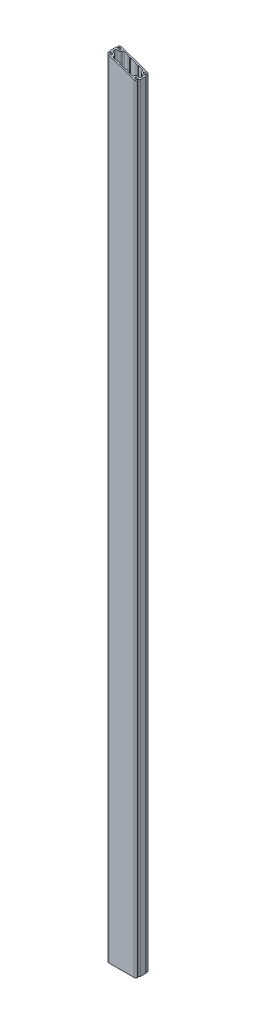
from build123d import *

# Parameters (mm, degrees)
SALIENTE_EXTRUIR1_DEPTH = 4733
CORTAR_EXTRUIR1_DEPTH   = 4735.531550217


with BuildPart() as part:
    # Croquis2 → Saliente-Extruir1 (new body)
    with BuildSketch(Plane(origin=(0, 0, 0), x_dir=(1, 0, 0), z_dir=(0, 1, 0))):
        with BuildLine():
            Line((90, -15.820430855), (90, 15.820430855))
            ThreePointArc((90, 15.820430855), (86.377431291, 21.479059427), (79.722019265, 20.557879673))
            ThreePointArc((79.722019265, 20.557879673), (69.104845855, 26.662756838), (81.19143785, 28.639671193))
            ThreePointArc((81.19143785, 28.639671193), (86.625966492, 27.069353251), (88.196284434, 32.503881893))
            ThreePointArc((88.196284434, 32.503881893), (82.872032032, 37.986118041), (75.5, 40))
            Line((75.5, 40), (-75.5, 40))
            ThreePointArc((-75.5, 40), (-82.872032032, 37.986118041), (-88.196284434, 32.503881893))
            ThreePointArc((-88.196284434, 32.503881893), (-86.625966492, 27.069353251), (-81.19143785, 28.639671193))
            ThreePointArc((-81.19143785, 28.639671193), (-69.104845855, 26.662756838), (-79.722019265, 20.557879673))
            ThreePointArc((-79.722019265, 20.557879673), (-86.377431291, 21.479059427), (-90, 15.820430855))
            Line((-90, 15.820430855), (-90, -15.820430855))
            ThreePointArc((-90, -15.820430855), (-86.377431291, -21.479059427), (-79.722019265, -20.557879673))
            ThreePointArc((-79.722019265, -20.557879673), (-69.104845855, -26.662756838), (-81.19143785, -28.639671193))
            ThreePointArc((-81.19143785, -28.639671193), (-86.625966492, -27.069353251), (-88.196284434, -32.503881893))
            ThreePointArc((-88.196284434, -32.503881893), (-82.872032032, -37.986118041), (-75.5, -40))
            Line((-75.5, -40), (75.5, -40))
            ThreePointArc((75.5, -40), (82.872032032, -37.986118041), (88.196284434, -32.503881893))
            ThreePointArc((88.196284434, -32.503881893), (86.625966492, -27.069353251), (81.19143785, -28.639671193))
            ThreePointArc((81.19143785, -28.639671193), (69.104845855, -26.662756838), (79.722019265, -20.557879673))
            ThreePointArc((79.722019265, -20.557879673), (86.377431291, -21.479059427), (90, -15.820430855))
        make_face()
        with BuildLine():
            Line((-17.482701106, 32), (17.482701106, 32))
            Line((17.482701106, 32), (20, 29))
            Line((20, 29), (30, 29))
            Line((30, 29), (32.517298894, 32))
            Line((32.517298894, 32), (54.5, 32))
            ThreePointArc((54.5, 32), (59.096194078, 30.096194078), (61, 25.5))
            ThreePointArc((61, 25.5), (65.246951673, 15.246951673), (75.5, 11))
            ThreePointArc((75.5, 11), (80.096194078, 9.096194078), (82, 4.5))
            Line((82, 4.5), (82, -4.5))
            ThreePointArc((82, -4.5), (80.096194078, -9.096194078), (75.5, -11))
            ThreePointArc((75.5, -11), (65.246951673, -15.246951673), (61, -25.5))
            ThreePointArc((61, -25.5), (59.096194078, -30.096194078), (54.5, -32))
            Line((54.5, -32), (32.517298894, -32))
            Line((32.517298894, -32), (30, -29))
            Line((30, -29), (20, -29))
            Line((20, -29), (17.482701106, -32))
            Line((17.482701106, -32), (-17.482701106, -32))
            Line((-17.482701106, -32), (-20, -29))
            Line((-20, -29), (-30, -29))
            Line((-30, -29), (-32.517298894, -32))
            Line((-32.517298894, -32), (-54.5, -32))
            ThreePointArc((-54.5, -32), (-59.096194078, -30.096194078), (-61, -25.5))
            ThreePointArc((-61, -25.5), (-65.246951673, -15.246951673), (-75.5, -11))
            ThreePointArc((-75.5, -11), (-80.096194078, -9.096194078), (-82, -4.5))
            Line((-82, -4.5), (-82, 4.5))
            ThreePointArc((-82, 4.5), (-80.096194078, 9.096194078), (-75.5, 11))
            ThreePointArc((-75.5, 11), (-65.246951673, 15.246951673), (-61, 25.5))
            ThreePointArc((-61, 25.5), (-59.096194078, 30.096194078), (-54.5, 32))
            Line((-54.5, 32), (-32.517298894, 32))
            Line((-32.517298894, 32), (-30, 29))
            Line((-30, 29), (-20, 29))
            Line((-20, 29), (-17.482701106, 32))
        make_face(mode=Mode.SUBTRACT)
    extrude(amount=SALIENTE_EXTRUIR1_DEPTH)

    # Croquis3 → Cortar-Extruir1 (cut, through all)
    with BuildSketch(Plane.XY.offset(40)):
        Polygon((-90, 4733), (90, 4733), (90, 4670.600000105), align=None)
    extrude(amount=-CORTAR_EXTRUIR1_DEPTH, mode=Mode.SUBTRACT)


solid = part.part
